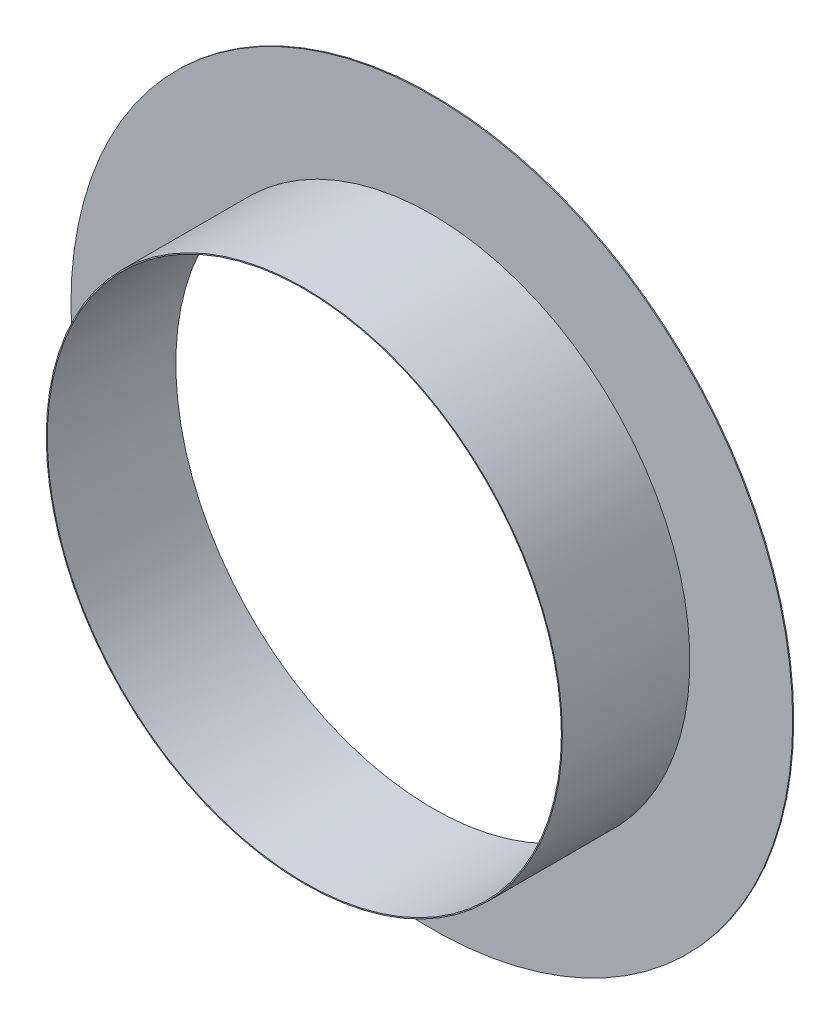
ISO-10303-21;
HEADER;
FILE_DESCRIPTION(('STEP AP214'),'2;1');
FILE_NAME('part.step','',(''),(''),'','','');
FILE_SCHEMA(('AUTOMOTIVE_DESIGN { 1 0 10303 214 1 1 1 1 }'));
ENDSEC;
DATA;
#1=APPLICATION_CONTEXT('core data for automotive mechanical design processes');
#2=APPLICATION_PROTOCOL_DEFINITION('international standard','automotive_design',2000,#1);
#3=PRODUCT_CONTEXT('',#1,'mechanical');
#4=PRODUCT('Part','Part','',(#3));
#5=PRODUCT_RELATED_PRODUCT_CATEGORY('part','',(#4));
#6=PRODUCT_DEFINITION_FORMATION('','',#4);
#7=PRODUCT_DEFINITION_CONTEXT('part definition',#1,'design');
#8=PRODUCT_DEFINITION('design','',#6,#7);
#9=PRODUCT_DEFINITION_SHAPE('','',#8);
#10=(LENGTH_UNIT() NAMED_UNIT(*) SI_UNIT(.MILLI.,.METRE.));
#11=(NAMED_UNIT(*) PLANE_ANGLE_UNIT() SI_UNIT($,.RADIAN.));
#12=(NAMED_UNIT(*) SI_UNIT($,.STERADIAN.) SOLID_ANGLE_UNIT());
#13=UNCERTAINTY_MEASURE_WITH_UNIT(LENGTH_MEASURE(1.E-05),#10,'distance_accuracy_value','');
#14=(GEOMETRIC_REPRESENTATION_CONTEXT(3) GLOBAL_UNCERTAINTY_ASSIGNED_CONTEXT((#13)) GLOBAL_UNIT_ASSIGNED_CONTEXT((#10,
#11,#12)) REPRESENTATION_CONTEXT('',''));
#15=CARTESIAN_POINT('',(0.,0.,0.));
#16=DIRECTION('',(0.,0.,1.));
#17=DIRECTION('',(1.,0.,0.));
#18=AXIS2_PLACEMENT_3D('',#15,#16,#17);
#19=CARTESIAN_POINT('',(0.,0.,250.));
#20=DIRECTION('',(0.,0.,-1.));
#21=DIRECTION('',(-1.,0.,0.));
#22=AXIS2_PLACEMENT_3D('',#19,#20,#21);
#23=CYLINDRICAL_SURFACE('',#22,502.);
#24=CARTESIAN_POINT('',(0.,0.,250.));
#25=DIRECTION('',(0.,0.,1.));
#26=DIRECTION('',(1.,0.,0.));
#27=AXIS2_PLACEMENT_3D('',#24,#25,#26);
#28=CIRCLE('',#27,502.);
#29=CARTESIAN_POINT('',(502.,0.,250.));
#30=VERTEX_POINT('',#29);
#31=EDGE_CURVE('E42',#30,#30,#28,.T.);
#32=ORIENTED_EDGE('',*,*,#31,.F.);
#33=EDGE_LOOP('',(#32));
#34=FACE_BOUND('',#33,.T.);
#35=CARTESIAN_POINT('',(0.,0.,2.));
#36=DIRECTION('',(0.,0.,-1.));
#37=DIRECTION('',(-1.,0.,0.));
#38=AXIS2_PLACEMENT_3D('',#35,#36,#37);
#39=CIRCLE('',#38,502.);
#40=CARTESIAN_POINT('',(-502.,0.,2.));
#41=VERTEX_POINT('',#40);
#42=EDGE_CURVE('E11',#41,#41,#39,.T.);
#43=ORIENTED_EDGE('',*,*,#42,.F.);
#44=EDGE_LOOP('',(#43));
#45=FACE_BOUND('',#44,.T.);
#46=ADVANCED_FACE('F36',(#34,#45),#23,.T.);
#47=CARTESIAN_POINT('',(0.,0.,250.));
#48=DIRECTION('',(0.,0.,1.));
#49=DIRECTION('',(1.,0.,0.));
#50=AXIS2_PLACEMENT_3D('',#47,#48,#49);
#51=PLANE('',#50);
#52=ORIENTED_EDGE('',*,*,#31,.T.);
#53=EDGE_LOOP('',(#52));
#54=FACE_BOUND('',#53,.T.);
#55=CARTESIAN_POINT('',(0.,0.,250.));
#56=DIRECTION('',(0.,0.,1.));
#57=DIRECTION('',(1.,0.,0.));
#58=AXIS2_PLACEMENT_3D('',#55,#56,#57);
#59=CIRCLE('',#58,500.);
#60=CARTESIAN_POINT('',(500.,0.,250.));
#61=VERTEX_POINT('',#60);
#62=EDGE_CURVE('E46',#61,#61,#59,.T.);
#63=ORIENTED_EDGE('',*,*,#62,.F.);
#64=EDGE_LOOP('',(#63));
#65=FACE_BOUND('',#64,.T.);
#66=ADVANCED_FACE('F74',(#54,#65),#51,.T.);
#67=CARTESIAN_POINT('',(0.,0.,0.));
#68=DIRECTION('',(0.,0.,1.));
#69=DIRECTION('',(1.,0.,0.));
#70=AXIS2_PLACEMENT_3D('',#67,#68,#69);
#71=PLANE('',#70);
#72=CARTESIAN_POINT('',(0.,0.,0.));
#73=DIRECTION('',(0.,0.,1.));
#74=DIRECTION('',(1.,0.,0.));
#75=AXIS2_PLACEMENT_3D('',#72,#73,#74);
#76=CIRCLE('',#75,500.);
#77=CARTESIAN_POINT('',(500.,0.,0.));
#78=VERTEX_POINT('',#77);
#79=EDGE_CURVE('E50',#78,#78,#76,.T.);
#80=ORIENTED_EDGE('',*,*,#79,.T.);
#81=EDGE_LOOP('',(#80));
#82=FACE_BOUND('',#81,.T.);
#83=CARTESIAN_POINT('',(0.,0.,0.));
#84=DIRECTION('',(0.,0.,-1.));
#85=DIRECTION('',(-1.,0.,0.));
#86=AXIS2_PLACEMENT_3D('',#83,#84,#85);
#87=CIRCLE('',#86,702.);
#88=CARTESIAN_POINT('',(-702.,0.,0.));
#89=VERTEX_POINT('',#88);
#90=EDGE_CURVE('E56',#89,#89,#87,.T.);
#91=ORIENTED_EDGE('',*,*,#90,.T.);
#92=EDGE_LOOP('',(#91));
#93=FACE_BOUND('',#92,.T.);
#94=ADVANCED_FACE('F79',(#82,#93),#71,.F.);
#95=CARTESIAN_POINT('',(0.,0.,250.));
#96=DIRECTION('',(0.,0.,-1.));
#97=DIRECTION('',(-1.,0.,0.));
#98=AXIS2_PLACEMENT_3D('',#95,#96,#97);
#99=CYLINDRICAL_SURFACE('',#98,500.);
#100=ORIENTED_EDGE('',*,*,#62,.T.);
#101=EDGE_LOOP('',(#100));
#102=FACE_BOUND('',#101,.T.);
#103=ORIENTED_EDGE('',*,*,#79,.F.);
#104=EDGE_LOOP('',(#103));
#105=FACE_BOUND('',#104,.T.);
#106=ADVANCED_FACE('F71',(#102,#105),#99,.F.);
#107=CARTESIAN_POINT('',(0.,0.,2.));
#108=DIRECTION('',(0.,0.,-1.));
#109=DIRECTION('',(-1.,0.,0.));
#110=AXIS2_PLACEMENT_3D('',#107,#108,#109);
#111=CYLINDRICAL_SURFACE('',#110,702.);
#112=CARTESIAN_POINT('',(0.,0.,2.));
#113=DIRECTION('',(0.,0.,-1.));
#114=DIRECTION('',(-1.,0.,0.));
#115=AXIS2_PLACEMENT_3D('',#112,#113,#114);
#116=CIRCLE('',#115,702.);
#117=CARTESIAN_POINT('',(-702.,0.,2.));
#118=VERTEX_POINT('',#117);
#119=EDGE_CURVE('E54',#118,#118,#116,.T.);
#120=ORIENTED_EDGE('',*,*,#119,.T.);
#121=EDGE_LOOP('',(#120));
#122=FACE_BOUND('',#121,.T.);
#123=ORIENTED_EDGE('',*,*,#90,.F.);
#124=EDGE_LOOP('',(#123));
#125=FACE_BOUND('',#124,.T.);
#126=ADVANCED_FACE('F62',(#122,#125),#111,.T.);
#127=CARTESIAN_POINT('',(0.,0.,2.));
#128=DIRECTION('',(0.,0.,-1.));
#129=DIRECTION('',(-1.,0.,0.));
#130=AXIS2_PLACEMENT_3D('',#127,#128,#129);
#131=PLANE('',#130);
#132=ORIENTED_EDGE('',*,*,#42,.T.);
#133=EDGE_LOOP('',(#132));
#134=FACE_BOUND('',#133,.T.);
#135=ORIENTED_EDGE('',*,*,#119,.F.);
#136=EDGE_LOOP('',(#135));
#137=FACE_BOUND('',#136,.T.);
#138=ADVANCED_FACE('F65',(#134,#137),#131,.F.);
#139=CLOSED_SHELL('',(#46,#66,#94,#106,#126,#138));
#140=MANIFOLD_SOLID_BREP('B2',#139);
#141=ADVANCED_BREP_SHAPE_REPRESENTATION('',(#18,#140),#14);
#142=SHAPE_DEFINITION_REPRESENTATION(#9,#141);
ENDSEC;
END-ISO-10303-21;
